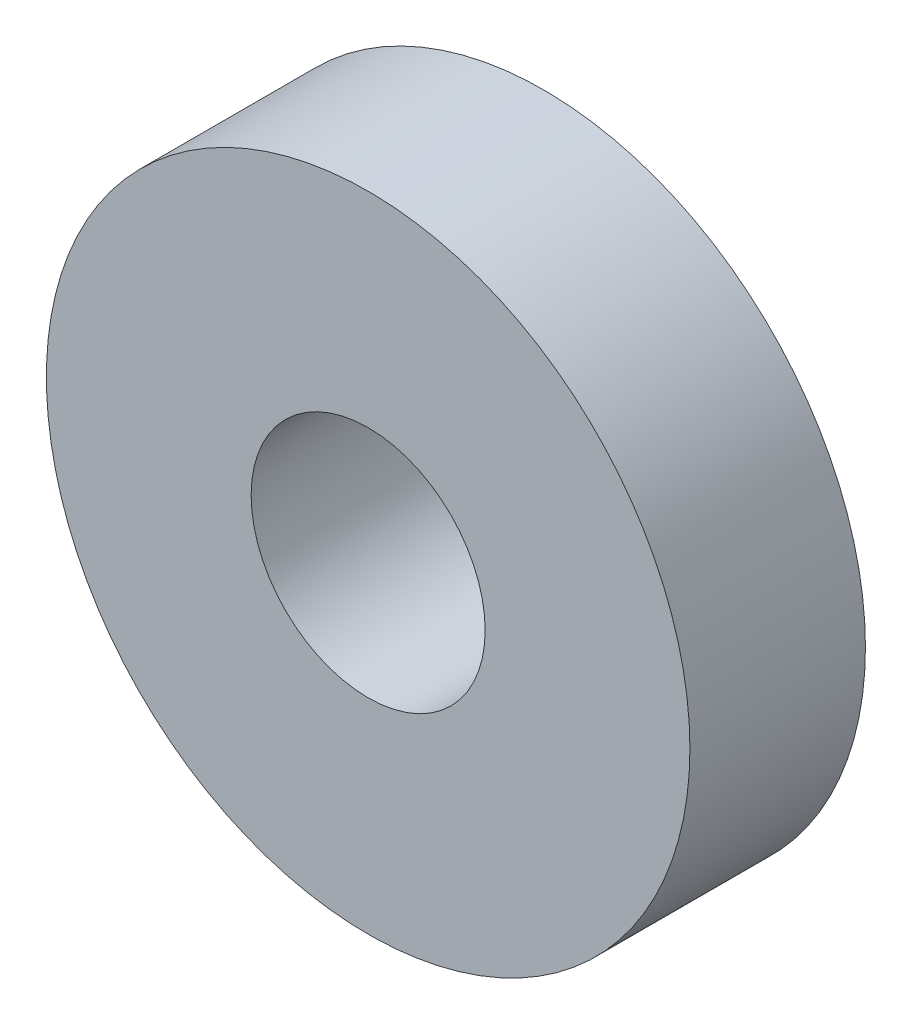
ISO-10303-21;
HEADER;
FILE_DESCRIPTION(('STEP AP214'),'2;1');
FILE_NAME('part.step','',(''),(''),'','','');
FILE_SCHEMA(('AUTOMOTIVE_DESIGN { 1 0 10303 214 1 1 1 1 }'));
ENDSEC;
DATA;
#1=APPLICATION_CONTEXT('core data for automotive mechanical design processes');
#2=APPLICATION_PROTOCOL_DEFINITION('international standard','automotive_design',2000,#1);
#3=PRODUCT_CONTEXT('',#1,'mechanical');
#4=PRODUCT('Part','Part','',(#3));
#5=PRODUCT_RELATED_PRODUCT_CATEGORY('part','',(#4));
#6=PRODUCT_DEFINITION_FORMATION('','',#4);
#7=PRODUCT_DEFINITION_CONTEXT('part definition',#1,'design');
#8=PRODUCT_DEFINITION('design','',#6,#7);
#9=PRODUCT_DEFINITION_SHAPE('','',#8);
#10=(LENGTH_UNIT() NAMED_UNIT(*) SI_UNIT(.MILLI.,.METRE.));
#11=(NAMED_UNIT(*) PLANE_ANGLE_UNIT() SI_UNIT($,.RADIAN.));
#12=(NAMED_UNIT(*) SI_UNIT($,.STERADIAN.) SOLID_ANGLE_UNIT());
#13=UNCERTAINTY_MEASURE_WITH_UNIT(LENGTH_MEASURE(1.E-05),#10,'distance_accuracy_value','');
#14=(GEOMETRIC_REPRESENTATION_CONTEXT(3) GLOBAL_UNCERTAINTY_ASSIGNED_CONTEXT((#13)) GLOBAL_UNIT_ASSIGNED_CONTEXT((#10,
#11,#12)) REPRESENTATION_CONTEXT('',''));
#15=CARTESIAN_POINT('',(0.,0.,0.));
#16=DIRECTION('',(0.,0.,1.));
#17=DIRECTION('',(1.,0.,0.));
#18=AXIS2_PLACEMENT_3D('',#15,#16,#17);
#19=CARTESIAN_POINT('',(0.,0.,6.));
#20=DIRECTION('',(0.,0.,1.));
#21=DIRECTION('',(1.,0.,0.));
#22=AXIS2_PLACEMENT_3D('',#19,#20,#21);
#23=PLANE('',#22);
#24=CARTESIAN_POINT('',(0.,0.,6.));
#25=DIRECTION('',(0.,0.,1.));
#26=DIRECTION('',(1.,0.,0.));
#27=AXIS2_PLACEMENT_3D('',#24,#25,#26);
#28=CIRCLE('',#27,11.);
#29=CARTESIAN_POINT('',(11.,0.,6.));
#30=VERTEX_POINT('',#29);
#31=EDGE_CURVE('E10',#30,#30,#28,.T.);
#32=ORIENTED_EDGE('',*,*,#31,.T.);
#33=EDGE_LOOP('',(#32));
#34=FACE_BOUND('',#33,.T.);
#35=CARTESIAN_POINT('',(0.,0.,6.));
#36=DIRECTION('',(0.,0.,1.));
#37=DIRECTION('',(1.,0.,0.));
#38=AXIS2_PLACEMENT_3D('',#35,#36,#37);
#39=CIRCLE('',#38,4.);
#40=CARTESIAN_POINT('',(4.,0.,6.));
#41=VERTEX_POINT('',#40);
#42=EDGE_CURVE('E41',#41,#41,#39,.T.);
#43=ORIENTED_EDGE('',*,*,#42,.F.);
#44=EDGE_LOOP('',(#43));
#45=FACE_BOUND('',#44,.T.);
#46=ADVANCED_FACE('F30',(#34,#45),#23,.T.);
#47=CARTESIAN_POINT('',(0.,0.,0.));
#48=DIRECTION('',(0.,0.,1.));
#49=DIRECTION('',(1.,0.,0.));
#50=AXIS2_PLACEMENT_3D('',#47,#48,#49);
#51=PLANE('',#50);
#52=CARTESIAN_POINT('',(0.,0.,0.));
#53=DIRECTION('',(0.,0.,1.));
#54=DIRECTION('',(1.,0.,0.));
#55=AXIS2_PLACEMENT_3D('',#52,#53,#54);
#56=CIRCLE('',#55,11.);
#57=CARTESIAN_POINT('',(11.,0.,0.));
#58=VERTEX_POINT('',#57);
#59=EDGE_CURVE('E34',#58,#58,#56,.T.);
#60=ORIENTED_EDGE('',*,*,#59,.F.);
#61=EDGE_LOOP('',(#60));
#62=FACE_BOUND('',#61,.T.);
#63=CARTESIAN_POINT('',(0.,0.,0.));
#64=DIRECTION('',(0.,0.,1.));
#65=DIRECTION('',(1.,0.,0.));
#66=AXIS2_PLACEMENT_3D('',#63,#64,#65);
#67=CIRCLE('',#66,4.);
#68=CARTESIAN_POINT('',(4.,0.,0.));
#69=VERTEX_POINT('',#68);
#70=EDGE_CURVE('E43',#69,#69,#67,.T.);
#71=ORIENTED_EDGE('',*,*,#70,.T.);
#72=EDGE_LOOP('',(#71));
#73=FACE_BOUND('',#72,.T.);
#74=ADVANCED_FACE('F53',(#62,#73),#51,.F.);
#75=CARTESIAN_POINT('',(0.,0.,6.));
#76=DIRECTION('',(0.,0.,-1.));
#77=DIRECTION('',(-1.,0.,0.));
#78=AXIS2_PLACEMENT_3D('',#75,#76,#77);
#79=CYLINDRICAL_SURFACE('',#78,11.);
#80=ORIENTED_EDGE('',*,*,#31,.F.);
#81=EDGE_LOOP('',(#80));
#82=FACE_BOUND('',#81,.T.);
#83=ORIENTED_EDGE('',*,*,#59,.T.);
#84=EDGE_LOOP('',(#83));
#85=FACE_BOUND('',#84,.T.);
#86=ADVANCED_FACE('F32',(#82,#85),#79,.T.);
#87=CARTESIAN_POINT('',(0.,0.,6.));
#88=DIRECTION('',(0.,0.,-1.));
#89=DIRECTION('',(-1.,0.,0.));
#90=AXIS2_PLACEMENT_3D('',#87,#88,#89);
#91=CYLINDRICAL_SURFACE('',#90,4.);
#92=ORIENTED_EDGE('',*,*,#42,.T.);
#93=EDGE_LOOP('',(#92));
#94=FACE_BOUND('',#93,.T.);
#95=ORIENTED_EDGE('',*,*,#70,.F.);
#96=EDGE_LOOP('',(#95));
#97=FACE_BOUND('',#96,.T.);
#98=ADVANCED_FACE('F49',(#94,#97),#91,.F.);
#99=CLOSED_SHELL('',(#46,#74,#86,#98));
#100=MANIFOLD_SOLID_BREP('B2',#99);
#101=ADVANCED_BREP_SHAPE_REPRESENTATION('',(#18,#100),#14);
#102=SHAPE_DEFINITION_REPRESENTATION(#9,#101);
ENDSEC;
END-ISO-10303-21;
